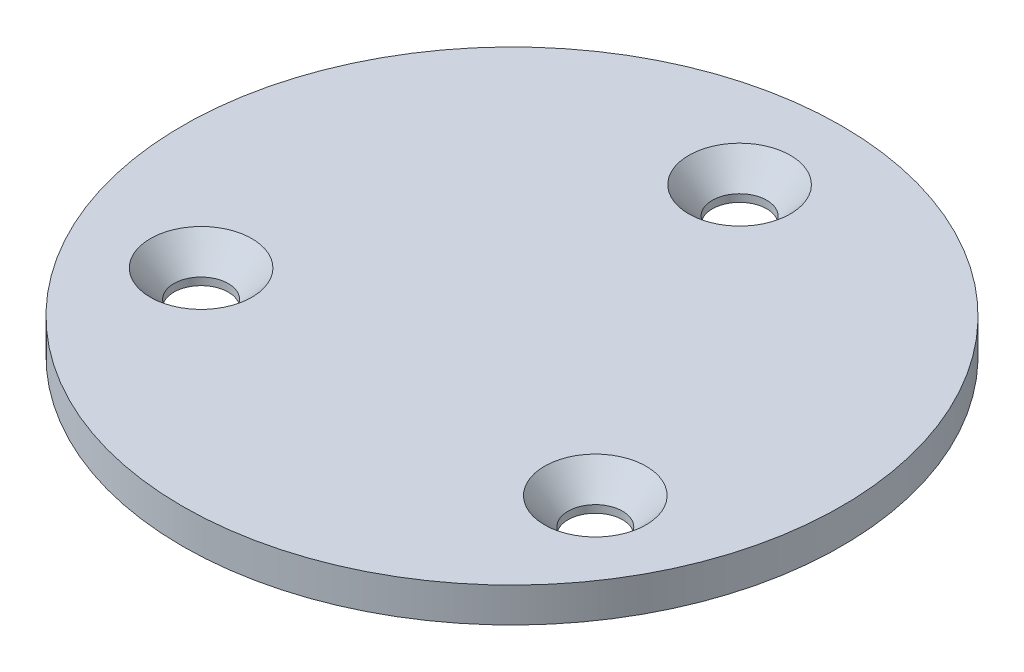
ISO-10303-21;
HEADER;
FILE_DESCRIPTION(('STEP AP214'),'2;1');
FILE_NAME('part.step','',(''),(''),'','','');
FILE_SCHEMA(('AUTOMOTIVE_DESIGN { 1 0 10303 214 1 1 1 1 }'));
ENDSEC;
DATA;
#1=APPLICATION_CONTEXT('core data for automotive mechanical design processes');
#2=APPLICATION_PROTOCOL_DEFINITION('international standard','automotive_design',2000,#1);
#3=PRODUCT_CONTEXT('',#1,'mechanical');
#4=PRODUCT('Part','Part','',(#3));
#5=PRODUCT_RELATED_PRODUCT_CATEGORY('part','',(#4));
#6=PRODUCT_DEFINITION_FORMATION('','',#4);
#7=PRODUCT_DEFINITION_CONTEXT('part definition',#1,'design');
#8=PRODUCT_DEFINITION('design','',#6,#7);
#9=PRODUCT_DEFINITION_SHAPE('','',#8);
#10=(LENGTH_UNIT() NAMED_UNIT(*) SI_UNIT(.MILLI.,.METRE.));
#11=(NAMED_UNIT(*) PLANE_ANGLE_UNIT() SI_UNIT($,.RADIAN.));
#12=(NAMED_UNIT(*) SI_UNIT($,.STERADIAN.) SOLID_ANGLE_UNIT());
#13=UNCERTAINTY_MEASURE_WITH_UNIT(LENGTH_MEASURE(1.E-05),#10,'distance_accuracy_value','');
#14=(GEOMETRIC_REPRESENTATION_CONTEXT(3) GLOBAL_UNCERTAINTY_ASSIGNED_CONTEXT((#13)) GLOBAL_UNIT_ASSIGNED_CONTEXT((#10,
#11,#12)) REPRESENTATION_CONTEXT('',''));
#15=CARTESIAN_POINT('',(0.,0.,0.));
#16=DIRECTION('',(0.,0.,1.));
#17=DIRECTION('',(1.,0.,0.));
#18=AXIS2_PLACEMENT_3D('',#15,#16,#17);
#19=CARTESIAN_POINT('',(0.,1.2065,0.));
#20=DIRECTION('',(0.,-1.,0.));
#21=DIRECTION('',(0.,0.,-1.));
#22=AXIS2_PLACEMENT_3D('',#19,#20,#21);
#23=CYLINDRICAL_SURFACE('',#22,22.987);
#24=CARTESIAN_POINT('',(0.,1.2065,0.));
#25=DIRECTION('',(0.,1.,0.));
#26=DIRECTION('',(0.,0.,1.));
#27=AXIS2_PLACEMENT_3D('',#24,#25,#26);
#28=CIRCLE('',#27,22.987);
#29=CARTESIAN_POINT('',(0.,1.2065,22.987));
#30=VERTEX_POINT('',#29);
#31=EDGE_CURVE('E10',#30,#30,#28,.T.);
#32=ORIENTED_EDGE('',*,*,#31,.F.);
#33=EDGE_LOOP('',(#32));
#34=FACE_BOUND('',#33,.T.);
#35=CARTESIAN_POINT('',(0.,-1.2065,0.));
#36=DIRECTION('',(0.,1.,0.));
#37=DIRECTION('',(0.,0.,1.));
#38=AXIS2_PLACEMENT_3D('',#35,#36,#37);
#39=CIRCLE('',#38,22.987);
#40=CARTESIAN_POINT('',(0.,-1.2065,22.987));
#41=VERTEX_POINT('',#40);
#42=EDGE_CURVE('E34',#41,#41,#39,.T.);
#43=ORIENTED_EDGE('',*,*,#42,.T.);
#44=EDGE_LOOP('',(#43));
#45=FACE_BOUND('',#44,.T.);
#46=ADVANCED_FACE('F31',(#34,#45),#23,.T.);
#47=CARTESIAN_POINT('',(0.,1.2065,0.));
#48=DIRECTION('',(0.,1.,0.));
#49=DIRECTION('',(0.,0.,1.));
#50=AXIS2_PLACEMENT_3D('',#47,#48,#49);
#51=PLANE('',#50);
#52=CARTESIAN_POINT('',(-13.748153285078,1.2065,7.93749999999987));
#53=DIRECTION('',(0.,1.,0.));
#54=DIRECTION('',(0.,0.,1.));
#55=AXIS2_PLACEMENT_3D('',#52,#53,#54);
#56=CIRCLE('',#55,3.5433);
#57=CARTESIAN_POINT('',(-13.748153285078,1.2065,11.4807999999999));
#58=VERTEX_POINT('',#57);
#59=EDGE_CURVE('E66',#58,#58,#56,.T.);
#60=ORIENTED_EDGE('',*,*,#59,.F.);
#61=EDGE_LOOP('',(#60));
#62=FACE_BOUND('',#61,.T.);
#63=CARTESIAN_POINT('',(13.7481532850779,1.2065,7.93750000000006));
#64=DIRECTION('',(0.,1.,0.));
#65=DIRECTION('',(0.,0.,1.));
#66=AXIS2_PLACEMENT_3D('',#63,#64,#65);
#67=CIRCLE('',#66,3.5433);
#68=CARTESIAN_POINT('',(13.7481532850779,1.2065,11.4808000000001));
#69=VERTEX_POINT('',#68);
#70=EDGE_CURVE('E57',#69,#69,#67,.T.);
#71=ORIENTED_EDGE('',*,*,#70,.F.);
#72=EDGE_LOOP('',(#71));
#73=FACE_BOUND('',#72,.T.);
#74=CARTESIAN_POINT('',(0.,1.2065,-15.875));
#75=DIRECTION('',(0.,1.,0.));
#76=DIRECTION('',(0.,0.,1.));
#77=AXIS2_PLACEMENT_3D('',#74,#75,#76);
#78=CIRCLE('',#77,3.5433);
#79=CARTESIAN_POINT('',(0.,1.2065,-12.3317));
#80=VERTEX_POINT('',#79);
#81=EDGE_CURVE('E48',#80,#80,#78,.T.);
#82=ORIENTED_EDGE('',*,*,#81,.F.);
#83=EDGE_LOOP('',(#82));
#84=FACE_BOUND('',#83,.T.);
#85=ORIENTED_EDGE('',*,*,#31,.T.);
#86=EDGE_LOOP('',(#85));
#87=FACE_BOUND('',#86,.T.);
#88=ADVANCED_FACE('F72',(#62,#73,#84,#87),#51,.T.);
#89=CARTESIAN_POINT('',(0.,-1.2065,0.));
#90=DIRECTION('',(0.,1.,0.));
#91=DIRECTION('',(0.,0.,1.));
#92=AXIS2_PLACEMENT_3D('',#89,#90,#91);
#93=PLANE('',#92);
#94=CARTESIAN_POINT('',(-13.748153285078,-1.2065,7.93749999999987));
#95=DIRECTION('',(0.,1.,0.));
#96=DIRECTION('',(0.,0.,1.));
#97=AXIS2_PLACEMENT_3D('',#94,#95,#96);
#98=CIRCLE('',#97,1.89865);
#99=CARTESIAN_POINT('',(-13.748153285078,-1.2065,9.83614999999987));
#100=VERTEX_POINT('',#99);
#101=EDGE_CURVE('E60',#100,#100,#98,.T.);
#102=ORIENTED_EDGE('',*,*,#101,.T.);
#103=EDGE_LOOP('',(#102));
#104=FACE_BOUND('',#103,.T.);
#105=CARTESIAN_POINT('',(13.7481532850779,-1.2065,7.93750000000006));
#106=DIRECTION('',(0.,1.,0.));
#107=DIRECTION('',(0.,0.,1.));
#108=AXIS2_PLACEMENT_3D('',#105,#106,#107);
#109=CIRCLE('',#108,1.89865);
#110=CARTESIAN_POINT('',(13.7481532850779,-1.2065,9.83615000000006));
#111=VERTEX_POINT('',#110);
#112=EDGE_CURVE('E51',#111,#111,#109,.T.);
#113=ORIENTED_EDGE('',*,*,#112,.T.);
#114=EDGE_LOOP('',(#113));
#115=FACE_BOUND('',#114,.T.);
#116=CARTESIAN_POINT('',(0.,-1.2065,-15.875));
#117=DIRECTION('',(0.,1.,0.));
#118=DIRECTION('',(0.,0.,1.));
#119=AXIS2_PLACEMENT_3D('',#116,#117,#118);
#120=CIRCLE('',#119,1.89865);
#121=CARTESIAN_POINT('',(0.,-1.2065,-13.97635));
#122=VERTEX_POINT('',#121);
#123=EDGE_CURVE('E41',#122,#122,#120,.T.);
#124=ORIENTED_EDGE('',*,*,#123,.T.);
#125=EDGE_LOOP('',(#124));
#126=FACE_BOUND('',#125,.T.);
#127=ORIENTED_EDGE('',*,*,#42,.F.);
#128=EDGE_LOOP('',(#127));
#129=FACE_BOUND('',#128,.T.);
#130=ADVANCED_FACE('F75',(#104,#115,#126,#129),#93,.F.);
#131=CARTESIAN_POINT('',(0.,1.2065,-15.875));
#132=DIRECTION('',(0.,1.,0.));
#133=DIRECTION('',(0.,0.,1.));
#134=AXIS2_PLACEMENT_3D('',#131,#132,#133);
#135=CYLINDRICAL_SURFACE('',#134,1.89864999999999);
#136=ORIENTED_EDGE('',*,*,#123,.F.);
#137=EDGE_LOOP('',(#136));
#138=FACE_BOUND('',#137,.T.);
#139=CARTESIAN_POINT('',(0.,-0.685453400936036,-15.875));
#140=DIRECTION('',(0.,1.,0.));
#141=DIRECTION('',(0.,0.,1.));
#142=AXIS2_PLACEMENT_3D('',#139,#140,#141);
#143=CIRCLE('',#142,1.89864999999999);
#144=CARTESIAN_POINT('',(0.,-0.685453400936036,-13.97635));
#145=VERTEX_POINT('',#144);
#146=EDGE_CURVE('E45',#145,#145,#143,.T.);
#147=ORIENTED_EDGE('',*,*,#146,.T.);
#148=EDGE_LOOP('',(#147));
#149=FACE_BOUND('',#148,.T.);
#150=ADVANCED_FACE('F84',(#138,#149),#135,.F.);
#151=CARTESIAN_POINT('',(0.,1.2065,-15.875));
#152=DIRECTION('',(0.,1.,0.));
#153=DIRECTION('',(0.,0.,1.));
#154=AXIS2_PLACEMENT_3D('',#151,#152,#153);
#155=CONICAL_SURFACE('',#154,3.5433,0.715584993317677);
#156=ORIENTED_EDGE('',*,*,#146,.F.);
#157=EDGE_LOOP('',(#156));
#158=FACE_BOUND('',#157,.T.);
#159=ORIENTED_EDGE('',*,*,#81,.T.);
#160=EDGE_LOOP('',(#159));
#161=FACE_BOUND('',#160,.T.);
#162=ADVANCED_FACE('F81',(#158,#161),#155,.F.);
#163=CARTESIAN_POINT('',(13.7481532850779,1.2065,7.93750000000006));
#164=DIRECTION('',(0.,1.,0.));
#165=DIRECTION('',(0.,0.,1.));
#166=AXIS2_PLACEMENT_3D('',#163,#164,#165);
#167=CYLINDRICAL_SURFACE('',#166,1.89864999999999);
#168=ORIENTED_EDGE('',*,*,#112,.F.);
#169=EDGE_LOOP('',(#168));
#170=FACE_BOUND('',#169,.T.);
#171=CARTESIAN_POINT('',(13.7481532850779,-0.685453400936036,7.93750000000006));
#172=DIRECTION('',(0.,1.,0.));
#173=DIRECTION('',(0.,0.,1.));
#174=AXIS2_PLACEMENT_3D('',#171,#172,#173);
#175=CIRCLE('',#174,1.89864999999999);
#176=CARTESIAN_POINT('',(13.7481532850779,-0.685453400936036,9.83615000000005));
#177=VERTEX_POINT('',#176);
#178=EDGE_CURVE('E54',#177,#177,#175,.T.);
#179=ORIENTED_EDGE('',*,*,#178,.T.);
#180=EDGE_LOOP('',(#179));
#181=FACE_BOUND('',#180,.T.);
#182=ADVANCED_FACE('F83',(#170,#181),#167,.F.);
#183=CARTESIAN_POINT('',(13.7481532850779,1.2065,7.93750000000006));
#184=DIRECTION('',(0.,1.,0.));
#185=DIRECTION('',(0.,0.,1.));
#186=AXIS2_PLACEMENT_3D('',#183,#184,#185);
#187=CONICAL_SURFACE('',#186,3.5433,0.715584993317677);
#188=ORIENTED_EDGE('',*,*,#178,.F.);
#189=EDGE_LOOP('',(#188));
#190=FACE_BOUND('',#189,.T.);
#191=ORIENTED_EDGE('',*,*,#70,.T.);
#192=EDGE_LOOP('',(#191));
#193=FACE_BOUND('',#192,.T.);
#194=ADVANCED_FACE('F91',(#190,#193),#187,.F.);
#195=CARTESIAN_POINT('',(-13.748153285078,1.2065,7.93749999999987));
#196=DIRECTION('',(0.,1.,0.));
#197=DIRECTION('',(0.,0.,1.));
#198=AXIS2_PLACEMENT_3D('',#195,#196,#197);
#199=CYLINDRICAL_SURFACE('',#198,1.89864999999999);
#200=ORIENTED_EDGE('',*,*,#101,.F.);
#201=EDGE_LOOP('',(#200));
#202=FACE_BOUND('',#201,.T.);
#203=CARTESIAN_POINT('',(-13.748153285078,-0.685453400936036,7.93749999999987));
#204=DIRECTION('',(0.,1.,0.));
#205=DIRECTION('',(0.,0.,1.));
#206=AXIS2_PLACEMENT_3D('',#203,#204,#205);
#207=CIRCLE('',#206,1.89864999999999);
#208=CARTESIAN_POINT('',(-13.748153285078,-0.685453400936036,9.83614999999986));
#209=VERTEX_POINT('',#208);
#210=EDGE_CURVE('E63',#209,#209,#207,.T.);
#211=ORIENTED_EDGE('',*,*,#210,.T.);
#212=EDGE_LOOP('',(#211));
#213=FACE_BOUND('',#212,.T.);
#214=ADVANCED_FACE('F119',(#202,#213),#199,.F.);
#215=CARTESIAN_POINT('',(-13.748153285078,1.2065,7.93749999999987));
#216=DIRECTION('',(0.,1.,0.));
#217=DIRECTION('',(0.,0.,1.));
#218=AXIS2_PLACEMENT_3D('',#215,#216,#217);
#219=CONICAL_SURFACE('',#218,3.5433,0.715584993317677);
#220=ORIENTED_EDGE('',*,*,#210,.F.);
#221=EDGE_LOOP('',(#220));
#222=FACE_BOUND('',#221,.T.);
#223=ORIENTED_EDGE('',*,*,#59,.T.);
#224=EDGE_LOOP('',(#223));
#225=FACE_BOUND('',#224,.T.);
#226=ADVANCED_FACE('F70',(#222,#225),#219,.F.);
#227=CLOSED_SHELL('',(#46,#88,#130,#150,#162,#182,#194,#214,#226));
#228=MANIFOLD_SOLID_BREP('B2',#227);
#229=ADVANCED_BREP_SHAPE_REPRESENTATION('',(#18,#228),#14);
#230=SHAPE_DEFINITION_REPRESENTATION(#9,#229);
ENDSEC;
END-ISO-10303-21;
